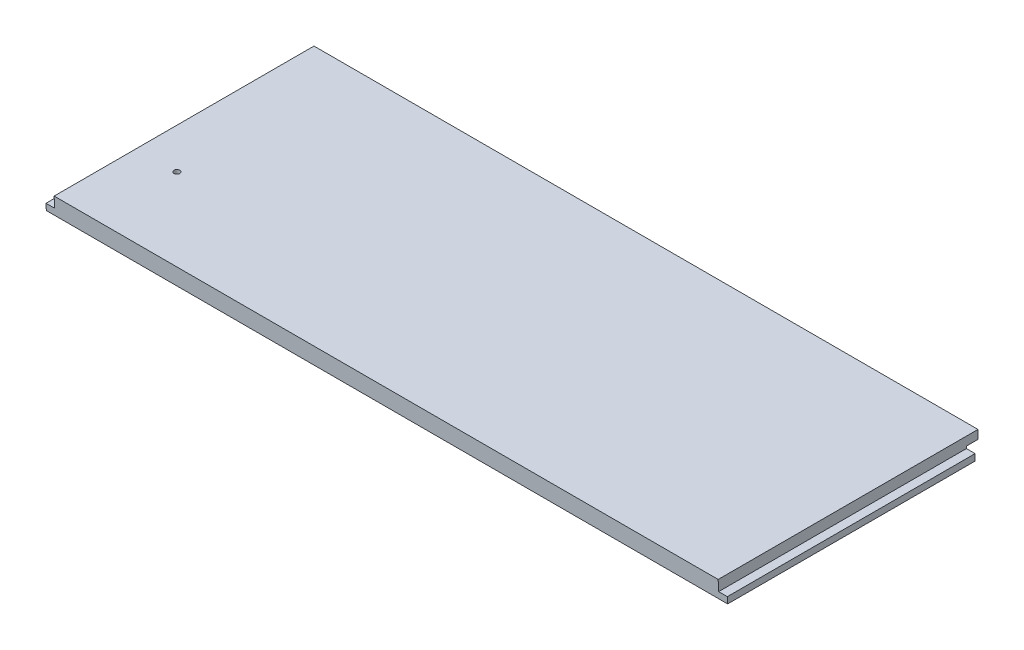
from build123d import *

# Parameters (mm, degrees)
SKETCH1_W               = 749.3
SKETCH1_H               = 285.75
BOSS_EXTRUDE1_DEPTH     = 19.05
CUT_EXTRUDE1_DEPTH      = 764.037782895
CUT_EXTRUDE1_DEPTH_BACK = 764.037782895
SKETCH3_W               = 9.525
SKETCH3_H               = 11.90625
CUT_EXTRUDE2_DEPTH      = 472.570342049
SKETCH4_W               = 12.7
SKETCH4_H               = 9.525
CUT_EXTRUDE3_DEPTH      = 764.037782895
SKETCH5_R               = 3.175
CUT_EXTRUDE4_DEPTH      = 402.420964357


with BuildPart() as part:
    # Sketch1 → Boss-Extrude1 (new body)
    with BuildSketch(Plane(origin=(0, 0, 0), x_dir=(1, 0, 0), z_dir=(0, 1, 0))):
        Rectangle(SKETCH1_W, SKETCH1_H)
    extrude(amount=-BOSS_EXTRUDE1_DEPTH)

    # Sketch2 → Cut-Extrude1 (cut, two sides: drawn at the far end of the back side and taken through both)
    with BuildSketch(Plane.ZY.offset(374.65).offset(-CUT_EXTRUDE1_DEPTH_BACK)):
        Polygon((170.739040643, 583.817518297), (142.875, 0), (140.688215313, -45.818308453), (112.824174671, -629.63582675), (1280.459211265, -685.363908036), (1338.374077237, 528.089437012), align=None)
    extrude(amount=CUT_EXTRUDE1_DEPTH + CUT_EXTRUDE1_DEPTH_BACK, mode=Mode.SUBTRACT)

    # Sketch3 → Cut-Extrude2 (cut, through all)
    with BuildSketch(Plane(origin=(0, 0, -142.875), x_dir=(-1, 0, 0), z_dir=(0, 0, -1))):
        with Locations((369.8875, -5.953125)):
            Rectangle(SKETCH3_W, SKETCH3_H)
        with Locations((-369.8875, -5.953125)):
            Rectangle(SKETCH3_W, SKETCH3_H)
    extrude(amount=-CUT_EXTRUDE2_DEPTH, mode=Mode.SUBTRACT)

    # Sketch4 → Cut-Extrude3 (cut, through all)
    with BuildSketch(Plane(origin=(374.65, 0, 0), x_dir=(0, 0, -1), z_dir=(1, 0, 0))):
        with Locations((136.525, -14.2875)):
            Rectangle(SKETCH4_W, SKETCH4_H)
    extrude(amount=-CUT_EXTRUDE3_DEPTH, mode=Mode.SUBTRACT)

    # Sketch5 → Cut-Extrude4 (cut, through all)
    with BuildSketch(Plane(origin=(0, 0, 0), x_dir=(1, 0, 0), z_dir=(0, 1, 0))):
        with Locations(Location((-320.675, -52.3875, 0), (0, 0, 270))):
            Circle(SKETCH5_R)
    extrude(amount=-CUT_EXTRUDE4_DEPTH, mode=Mode.SUBTRACT)


solid = part.part
